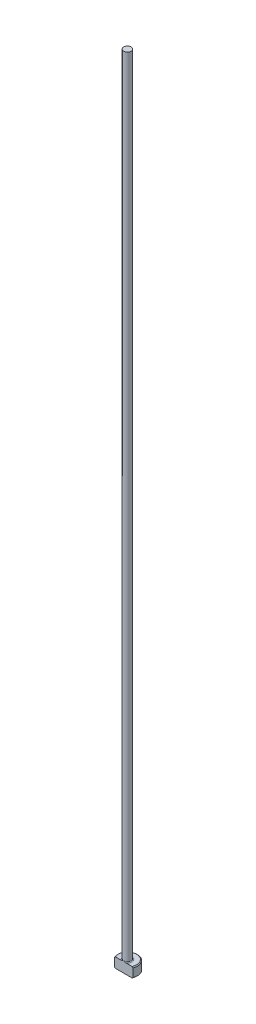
from build123d import *

# Parameters (mm, degrees)
CHAMFER1_SIZE = 0.254
FILLET1_R     = 0.254
KEY_DEPTH     = 255.0396844


with BuildPart() as part:
    # Sketch1 → Revolve1 (revolve)
    with BuildSketch(Plane.XY, mode=Mode.PRIVATE) as revolve1_sk:
        Polygon((0, 0), (-3.175, 0), (-3.175, 3.175), (-1.18999, 3.175), (-1.18999, 254), (0, 254), align=None)
    revolve(revolve1_sk.sketch.rotate(Axis((0, 259.958771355, 0), (0, -1, 0)), 270), axis=Axis((0, 259.958771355, 0), (0, -1, 0)))

    # Chamfer1
    chamfer1_edges = [part.edges().sort_by_distance(p)[0] for p in [
        (0, 3.175, -3.175),
        (0, 0, -3.175),
    ]]
    chamfer(chamfer1_edges, length=CHAMFER1_SIZE)

    # Fillet1
    fillet1_edges = [part.edges().sort_by_distance(p)[0] for p in [
        (0, 3.175, -1.18999),
    ]]
    fillet(fillet1_edges, radius=FILLET1_R)

    # Sketch2 → Key (cut, through all)
    with BuildSketch(Plane(origin=(0, 0, 0), x_dir=(1, 0, 0), z_dir=(0, 1, 0))):
        with BuildLine():
            Line((-2.943560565, -1.18999), (2.943560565, -1.18999))
            ThreePointArc((2.943560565, -1.18999), (0, -3.175), (-2.943560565, -1.18999))
        make_face()
    extrude(amount=KEY_DEPTH, mode=Mode.SUBTRACT)


solid = part.part
